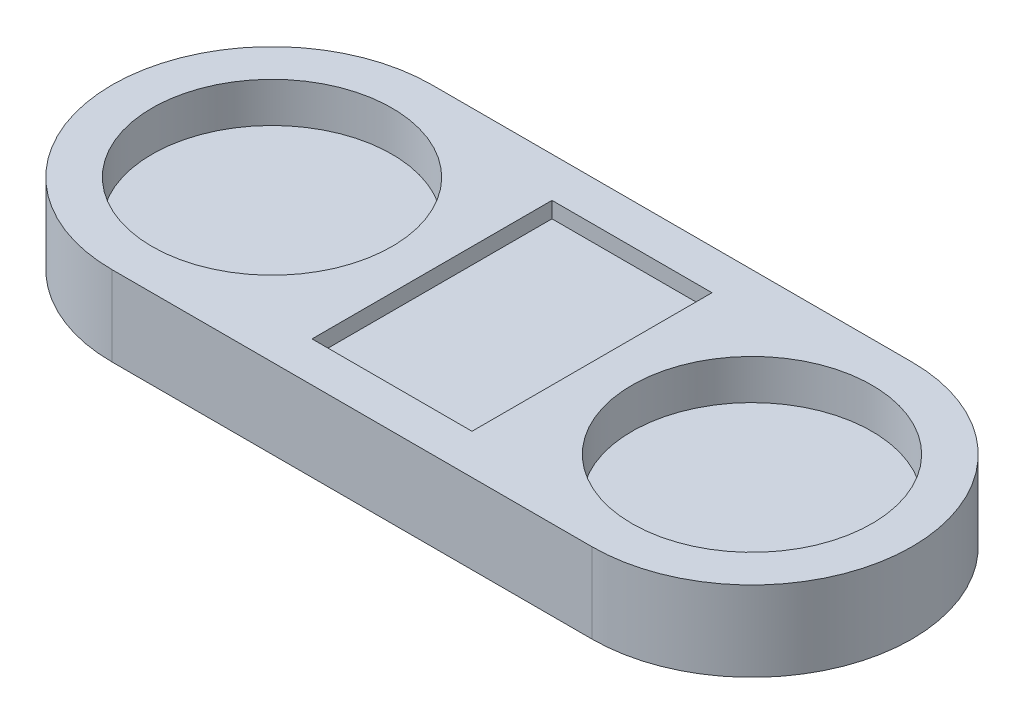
from build123d import *

# Parameters (mm, degrees)
SKETCH1_W          = 127
SKETCH1_H          = 50.8
EXTRUDE1_DEPTH     = 12.7
FILLET1_RADIUS     = 25.4
FILLET1_LENGTH     = 12.7
FILLET2_RADIUS     = 25.4
FILLET2_LENGTH     = 12.7
SKETCH2_R          = 19.05
CUT_EXTRUDE1_DEPTH = 6.35
SKETCH3_W          = 25.4
SKETCH3_H          = 38.1
CUT_EXTRUDE2_DEPTH = 2.54


with BuildPart() as part:
    # Sketch1 → Extrude1 (new body)
    with BuildSketch(Plane(origin=(0, 0, 0), x_dir=(1, 0, 0), z_dir=(0, 1, 0))):
        Rectangle(SKETCH1_W, SKETCH1_H)
    extrude(amount=EXTRUDE1_DEPTH)

    # Fillet1: full round fillet: the end face becomes a half cylinder, R = half its width
    fillet1_face = Plane((-63.5, 6.35, 0), x_dir=(0, -1, 0), z_dir=(-1, 0, 0))  # on the end face: x along it, z out of the body
    fillet1_slab = fillet1_face.offset(-FILLET1_RADIUS / 2) * Box(FILLET1_LENGTH, 2 * FILLET1_RADIUS, FILLET1_RADIUS, mode=Mode.PRIVATE)  # the body's end, R deep
    fillet1_round = Plane((-38.1, 6.35, 0), x_dir=(-1, 0, 0), z_dir=(0, -1, 0)) * Cylinder(FILLET1_RADIUS, FILLET1_LENGTH, mode=Mode.PRIVATE)  # its axis R under the face
    add(fillet1_slab - fillet1_round, mode=Mode.SUBTRACT)

    # Fillet2: full round fillet: the end face becomes a half cylinder, R = half its width
    fillet2_face = Plane((63.5, 6.35, 0), x_dir=(0, 1, 0), z_dir=(1, 0, 0))  # on the end face: x along it, z out of the body
    fillet2_slab = fillet2_face.offset(-FILLET2_RADIUS / 2) * Box(FILLET2_LENGTH, 2 * FILLET2_RADIUS, FILLET2_RADIUS, mode=Mode.PRIVATE)  # the body's end, R deep
    fillet2_round = Plane((38.1, 6.35, 0), x_dir=(1, 0, 0), z_dir=(0, 1, 0)) * Cylinder(FILLET2_RADIUS, FILLET2_LENGTH, mode=Mode.PRIVATE)  # its axis R under the face
    add(fillet2_slab - fillet2_round, mode=Mode.SUBTRACT)

    # Sketch2 → Cut-Extrude1 (cut)
    with BuildSketch(Plane(origin=(0, 12.7, 0), x_dir=(-1, 0, 0), z_dir=(0, 1, 0))):
        with Locations(Location((38.1, 0, 0), (0, 0, 90))):
            Circle(SKETCH2_R)
        with Locations(Location((-38.1, 0, 0), (0, 0, 90))):
            Circle(SKETCH2_R)
    extrude(amount=-CUT_EXTRUDE1_DEPTH, mode=Mode.SUBTRACT)

    # Sketch3 → Cut-Extrude2 (cut)
    with BuildSketch(Plane(origin=(0, 12.7, 0), x_dir=(-1, 0, 0), z_dir=(0, 1, 0))):
        Rectangle(SKETCH3_W, SKETCH3_H)
    extrude(amount=-CUT_EXTRUDE2_DEPTH, mode=Mode.SUBTRACT)


solid = part.part
